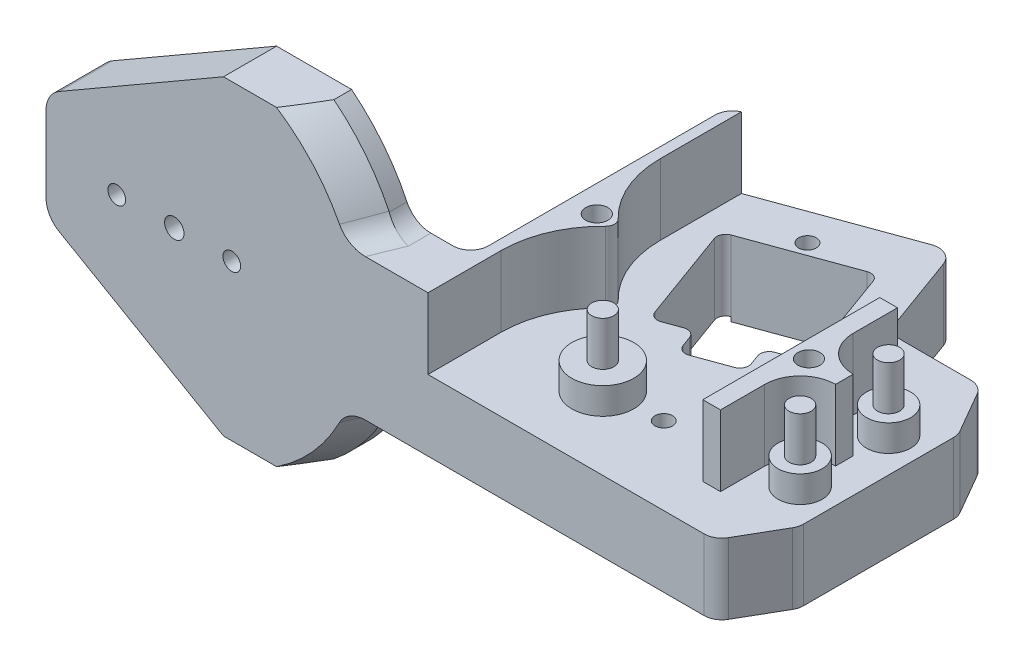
from build123d import *

# Parameters (mm, degrees)
SKETCH1_R             = 22.5
BOSS_EXTRUDE1_DEPTH   = 2
BOSS_EXTRUDE2_START   = 2
SKETCH1_2_R           = 22.5
BOSS_EXTRUDE2_DEPTH   = 4
BOSS_EXTRUDE2_TAPER   = 20
BOSS_EXTRUDE3_DEPTH   = 8
BOSS_EXTRUDE4_REACH   = 67.504
FILLET1_R             = 3
CUT_EXTRUDE1_DEPTH    = 8
FILLET2_R             = 2
SKETCH9_R             = 0.5
SKETCH9_R_2           = 4.5
SKETCH9_R_3           = 3.5
SKETCH9_R_4           = 1
SKETCH9_R_5           = 1.1
CUT_EXTRUDE4_DEPTH    = 1
SKETCH9_4_R           = 1
SKETCH9_4_R_2         = 1.1
CUT_EXTRUDE5_DEPTH    = 77.919818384
SKETCH18_R            = 3.5
SKETCH18_R_2          = 2.5
BOSS_EXTRUDE6_DEPTH   = 3
SKETCH19_R            = 1.25
BOSS_EXTRUDE7_DEPTH   = 5
CUT_EXTRUDE6_DEPTH    = 77.919818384
CUT_EXTRUDE7_START    = -5
CUT_EXTRUDE7_DEPTH    = 5
BOSS_EXTRUDE8_DEPTH   = 0.5
M3_CLEARANCE_HOLE1_D  = 2
CUT_EXTRUDE8_DEPTH    = 77.919818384
FILLET3_R             = 3
M3_TAPPED_HOLE1_D     = 2.5
M3_TAPPED_HOLE1_DEPTH = 12
M3_TAPPED_HOLE1_TIP   = 0.751075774


with BuildPart() as part:
    # Sketch1 → Boss-Extrude1 (new body)
    with BuildSketch(Plane.XY):
        Circle(SKETCH1_R)
    extrude(amount=BOSS_EXTRUDE1_DEPTH)

    # Sketch1_2 → Boss-Extrude2 (add)
    with BuildSketch(Plane.XY.offset(BOSS_EXTRUDE2_START)):
        Circle(SKETCH1_2_R)
    extrude(amount=BOSS_EXTRUDE2_DEPTH, taper=BOSS_EXTRUDE2_TAPER)


with BuildPart() as body_2:
    # Sketch3 → Boss-Extrude3 (new, symmetric)
    with BuildSketch(Plane(origin=(0, 0, 0), x_dir=(1, 0, 0), z_dir=(0, 1, 0))):
        Polygon((21.044119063, -6), (61.044119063, -6), (64.544119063, 0.062177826), (64.544119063, 18.062177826), (61.044119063, 24.124355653), (50.558144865, 24.124355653), (46.293852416, 35.840402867), (27.5, 29), (27.5, 0), (22.5, 0), (22.5, -2), align=None)
    extrude(amount=BOSS_EXTRUDE3_DEPTH, both=True)


    # Sketch5 → Boss-Extrude4 (add, up to next)
    with BuildSketch(Plane.ZY.offset(-27.5), mode=Mode.PRIVATE) as boss_extrude4_sk1:
        Polygon((0, -8), (2, -8), (6, -8), (6, 8), (2, 8), (0, 8), align=None)
    boss_extrude4_tool1 = extrude(boss_extrude4_sk1.sketch, amount=BOSS_EXTRUDE4_REACH, mode=Mode.PRIVATE) - part.part
    add(boss_extrude4_tool1.solids().sort_by_distance((27.5, 0, 3))[0])


with BuildPart() as part_1:
    add(part.part)

    # Combine1: union body 2
    add(body_2.part)

    # Fillet1
    fillet1_edges = [part_1.edges().sort_by_distance(p)[0] for p in [
        (20.248742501, 8, 4.000694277),
        (20.248742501, -8, 4.000694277),
        (21.029740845, 8, 1),
        (21.029740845, -8, 1),
    ]]
    fillet(fillet1_edges, radius=FILLET1_R)

    # Sketch6 → Cut-Extrude1 (cut)
    with BuildSketch(Plane(origin=(0, 8, 0), x_dir=(1, 0, 0), z_dir=(0, 1, 0))):
        with BuildLine():
            Line((28.674981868, 2.2558549), (28.674981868, -6))
            Line((28.674981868, -6), (61.044119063, -6))
            Line((61.044119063, -6), (64.544119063, 0.062177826))
            Line((64.544119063, 0.062177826), (64.544119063, 18.062177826))
            Line((64.544119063, 18.062177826), (61.044119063, 24.124355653))
            Line((61.044119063, 24.124355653), (50.558144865, 24.124355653))
            Line((50.558144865, 24.124355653), (46.293852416, 35.840402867))
            Line((46.293852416, 35.840402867), (28.674981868, 29.427658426))
            Line((28.674981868, 29.427658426), (28.674981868, 20.2558549))
            ThreePointArc((28.674981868, 20.2558549), (29.591313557, 15.757414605), (32.194280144, 11.9758549))
            ThreePointArc((32.194280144, 11.9758549), (32.500306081, 11.2558549), (32.194280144, 10.5358549))
            ThreePointArc((32.194280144, 10.5358549), (29.591313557, 6.754295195), (28.674981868, 2.2558549))
        make_face()
        with BuildLine():
            Line((54.674981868, -0.937822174), (54.674981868, 19.062177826))
            Line((54.674981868, 19.062177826), (56.674981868, 19.062177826))
            Line((56.674981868, 19.062177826), (56.674981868, 14.062177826))
            ThreePointArc((56.674981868, 14.062177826), (57.846554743, 11.233750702), (60.674981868, 10.062177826))
            Line((60.674981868, 10.062177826), (60.674981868, 8.062177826))
            ThreePointArc((60.674981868, 8.062177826), (57.846554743, 6.890604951), (56.674981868, 4.062177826))
            Line((56.674981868, 4.062177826), (56.674981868, -0.937822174))
            Line((56.674981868, -0.937822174), (54.674981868, -0.937822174))
        make_face(mode=Mode.SUBTRACT)
    extrude(amount=-CUT_EXTRUDE1_DEPTH, mode=Mode.SUBTRACT)

    # Fillet2
    fillet2_edges = [part_1.edges().sort_by_distance(p)[0] for p in [
        (27.5, 0, 0),
        (27.5, 0, -29),
        (46.293852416, -4, -35.840402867),
        (50.558144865, -4, -24.124355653),
        (61.044119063, -4, -24.124355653),
        (64.544119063, -4, -18.062177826),
        (64.544119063, -4, -0.062177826),
        (61.044119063, -4, 6),
    ]]
    fillet(fillet2_edges, radius=FILLET2_R)

    # Sketch9 → Cut-Extrude4 (cut)
    # profile 1 of 8: a face of its own
    with BuildSketch(Plane(origin=(0, 0, 0), x_dir=(-1, 0, 0), z_dir=(0, 0, -1))):
        with BuildLine():
            Line((-6.5, 2), (-4.031128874, 2))
            ThreePointArc((-4.031128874, 2), (-3.726313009, 2.522814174), (-3.354101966, 3))
            Line((-3.354101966, 3), (-6.5, 3))
            ThreePointArc((-6.5, 3), (-9.5, 0), (-6.5, -3))
            Line((-6.5, -3), (-3.354101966, -3))
            ThreePointArc((-3.354101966, -3), (-3.726313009, -2.522814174), (-4.031128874, -2))
            Line((-4.031128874, -2), (-6.5, -2))
            ThreePointArc((-6.5, -2), (-8.5, 0), (-6.5, 2))
        make_face()
    # profile 2 of 8: a face of its own
    with BuildSketch(Plane(origin=(0, 0, 0), x_dir=(-1, 0, 0), z_dir=(0, 0, -1))):
        with Locations((4.5, 0)):
            Circle(SKETCH9_R)
    # profile 3 of 8: a face of its own
    with BuildSketch(Plane(origin=(0, 0, 0), x_dir=(-1, 0, 0), z_dir=(0, 0, -1))):
        Circle(SKETCH9_R_2)
        Circle(SKETCH9_R_3, mode=Mode.SUBTRACT)
    # profile 4 of 8: a face of its own
    with BuildSketch(Plane(origin=(0, 0, 0), x_dir=(-1, 0, 0), z_dir=(0, 0, -1))):
        with Locations((-4.5, 0)):
            Circle(SKETCH9_R)
    # profile 5 of 8: a face of its own
    with BuildSketch(Plane(origin=(0, 0, 0), x_dir=(-1, 0, 0), z_dir=(0, 0, -1))):
        with BuildLine():
            ThreePointArc((-4.472222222, 0.499227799), (-4.317386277, 1.268927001), (-4.031128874, 2))
            Line((-4.031128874, 2), (-6.5, 2))
            ThreePointArc((-6.5, 2), (-8.5, 0), (-6.5, -2))
            Line((-6.5, -2), (-4.031128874, -2))
            ThreePointArc((-4.031128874, -2), (-4.317386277, -1.268927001), (-4.472222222, -0.499227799))
            ThreePointArc((-4.472222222, -0.499227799), (-5, 0), (-4.472222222, 0.499227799))
        make_face()
        with Locations((-6.5, 0)):
            Circle(SKETCH9_R_4, mode=Mode.SUBTRACT)
    # profile 6 of 8: a face of its own
    with BuildSketch(Plane(origin=(0, 0, 0), x_dir=(-1, 0, 0), z_dir=(0, 0, -1))):
        Circle(SKETCH9_R_3)
        Circle(SKETCH9_R_5, mode=Mode.SUBTRACT)
    # profile 7 of 8: a face of its own
    with BuildSketch(Plane(origin=(0, 0, 0), x_dir=(-1, 0, 0), z_dir=(0, 0, -1))):
        with BuildLine():
            Line((6.500000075, 3), (3.354101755, 3.000000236))
            ThreePointArc((3.354101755, 3.000000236), (3.726312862, 2.522814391), (4.031128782, 2.000000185))
            Line((4.031128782, 2.000000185), (6.5, 2))
            ThreePointArc((6.5, 2), (8.5, 0), (6.5, -2))
            Line((6.5, -2), (4.031128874, -2))
            ThreePointArc((4.031128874, -2), (3.726313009, -2.522814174), (3.354101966, -3))
            Line((3.354101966, -3), (6.5, -3))
            ThreePointArc((6.5, -3), (9.5, -3.8e-08), (6.500000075, 3))
        make_face()
    # profile 8 of 8: a face of its own
    with BuildSketch(Plane(origin=(0, 0, 0), x_dir=(-1, 0, 0), z_dir=(0, 0, -1))):
        with BuildLine():
            Line((6.5, 2), (4.031128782, 2.000000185))
            ThreePointArc((4.031128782, 2.000000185), (4.317386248, 1.2689271), (4.472222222, 0.499227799))
            ThreePointArc((4.472222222, 0.499227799), (4.843592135, 0.363241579), (5, 0))
            ThreePointArc((5, 0), (4.843592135, -0.363241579), (4.472222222, -0.499227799))
            ThreePointArc((4.472222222, -0.499227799), (4.317386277, -1.268927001), (4.031128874, -2))
            Line((4.031128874, -2), (6.5, -2))
            ThreePointArc((6.5, -2), (8.5, 0), (6.5, 2))
        make_face()
        with Locations((6.5, 0)):
            Circle(SKETCH9_R_4, mode=Mode.SUBTRACT)
    extrude(amount=-CUT_EXTRUDE4_DEPTH, mode=Mode.SUBTRACT)

    # Sketch9_4 → Cut-Extrude5 (cut, through all)
    with BuildSketch(Plane(origin=(0, 0, 0), x_dir=(-1, 0, 0), z_dir=(0, 0, -1))):
        with Locations((-6.5, 0)):
            Circle(SKETCH9_4_R)
        Circle(SKETCH9_4_R_2)
        with Locations((6.5, 0)):
            Circle(SKETCH9_4_R)
    extrude(amount=-CUT_EXTRUDE5_DEPTH, mode=Mode.SUBTRACT)

    # Sketch18 → Boss-Extrude6 (add)
    with BuildSketch(Plane(origin=(0, 0, 0), x_dir=(1, 0, 0), z_dir=(0, 1, 0))):
        with Locations(Location((40.174981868, 2.2558549, 0), (0, 0, 270))):
            Circle(SKETCH18_R)
        with Locations(Location((60.674981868, 14.062177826, 0), (0, 0, 270))):
            Circle(SKETCH18_R_2)
        with Locations(Location((60.674981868, 4.062177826, 0), (0, 0, 270))):
            Circle(SKETCH18_R_2)
    extrude(amount=BOSS_EXTRUDE6_DEPTH)

    # Sketch19 → Boss-Extrude7 (add)
    with BuildSketch(Plane(origin=(0, 3, 0), x_dir=(1, 0, 0), z_dir=(0, 1, 0))):
        with Locations(Location((40.174981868, 2.2558549, 0), (0, 0, 270))):
            Circle(SKETCH19_R)
        with Locations(Location((60.674981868, 14.062177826, 0), (0, 0, 270))):
            Circle(SKETCH19_R)
        with Locations(Location((60.674981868, 4.062177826, 0), (0, 0, 270))):
            Circle(SKETCH19_R)
    extrude(amount=BOSS_EXTRUDE7_DEPTH)

    # Sketch20 → Cut-Extrude6 (cut, through all)
    with BuildSketch(Plane(origin=(0, 0, 0), x_dir=(1, 0, 0), z_dir=(0, 1, 0))):
        with BuildLine():
            Line((32.14268514, 24.781582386), (43.418996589, 28.885824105))
            ThreePointArc((43.418996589, 28.885824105), (44.183634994, 28.852439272), (44.700709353, 28.288151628))
            Line((44.700709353, 28.288151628), (48.548435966, 17.716609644))
            ThreePointArc((48.548435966, 17.716609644), (48.515051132, 16.951971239), (47.950763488, 16.43489688))
            Line((47.950763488, 16.43489688), (46.07607965, 15.752567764))
            ThreePointArc((46.07607965, 15.752567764), (45.511792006, 15.235493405), (45.478407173, 14.470855))
            Line((45.478407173, 14.470855), (45.905932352, 13.296239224))
            ThreePointArc((45.905932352, 13.296239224), (45.872547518, 12.531600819), (45.308259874, 12.01452646))
            Line((45.308259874, 12.01452646), (41.540086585, 10.643023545))
            ThreePointArc((41.540086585, 10.643023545), (40.775448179, 10.676408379), (40.25837382, 11.240696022))
            Line((40.25837382, 11.240696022), (39.830848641, 12.415311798))
            ThreePointArc((39.830848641, 12.415311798), (39.313774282, 12.979599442), (38.549135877, 13.012984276))
            Line((38.549135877, 13.012984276), (36.674452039, 12.33065516))
            ThreePointArc((36.674452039, 12.33065516), (35.909813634, 12.364039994), (35.392739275, 12.928327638))
            Line((35.392739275, 12.928327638), (31.545012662, 23.499869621))
            ThreePointArc((31.545012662, 23.499869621), (31.578397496, 24.264508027), (32.14268514, 24.781582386))
        make_face()
    extrude(amount=-CUT_EXTRUDE6_DEPTH, mode=Mode.SUBTRACT)

    # Sketch21 → Cut-Extrude7 (cut)
    with BuildSketch(Plane.XZ.offset(8).offset(CUT_EXTRUDE7_START)):
        with BuildLine():
            Line((49.140832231, -16.089014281), (52.56717265, -6.67522135))
            Line((52.56717265, -6.67522135), (39.411475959, -1.886939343))
            Line((39.411475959, -1.886939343), (35.98513554, -11.300732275))
            Line((35.98513554, -11.300732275), (35.392739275, -12.928327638))
            ThreePointArc((35.392739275, -12.928327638), (35.909813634, -12.364039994), (36.674452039, -12.33065516))
            Line((36.674452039, -12.33065516), (38.549135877, -13.012984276))
            ThreePointArc((38.549135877, -13.012984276), (39.313774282, -12.979599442), (39.830848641, -12.415311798))
            Line((39.830848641, -12.415311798), (40.25837382, -11.240696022))
            ThreePointArc((40.25837382, -11.240696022), (40.775448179, -10.676408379), (41.540086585, -10.643023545))
            Line((41.540086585, -10.643023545), (45.308259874, -12.01452646))
            ThreePointArc((45.308259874, -12.01452646), (45.872547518, -12.531600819), (45.905932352, -13.296239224))
            Line((45.905932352, -13.296239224), (45.478407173, -14.470855))
            ThreePointArc((45.478407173, -14.470855), (45.511792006, -15.235493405), (46.07607965, -15.752567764))
            Line((46.07607965, -15.752567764), (47.950763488, -16.43489688))
            ThreePointArc((47.950763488, -16.43489688), (48.515051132, -16.951971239), (48.548435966, -17.716609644))
            Line((48.548435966, -17.716609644), (49.140832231, -16.089014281))
        make_face()
    extrude(amount=CUT_EXTRUDE7_DEPTH, mode=Mode.SUBTRACT)

    # Sketch22 → Boss-Extrude8 (add)
    with BuildSketch(Plane.XZ.offset(8)):
        Polygon((52.995560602, -2.574430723), (41.719249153, 1.529810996), (40.35116858, -2.228959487), (51.627480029, -6.333201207), align=None)
        Polygon((42.050916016, -32.644594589), (43.418996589, -28.885824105), (32.14268514, -24.781582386), (30.774604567, -28.540352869), align=None)
    extrude(amount=BOSS_EXTRUDE8_DEPTH)

    # M3 Clearance Hole1 (through all)
    with Locations(Plane(origin=(0, -8.5, 0), x_dir=(-1, 0, 0), z_dir=(0, -1, 0))):
        with Locations((-37.23846996, 28.323855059), (-46.531695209, 2.790928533)):
            Hole(M3_CLEARANCE_HOLE1_D / 2)

    # Sketch26 → Cut-Extrude8 (cut, through all)
    with BuildSketch(Plane(origin=(0, 0, 0), x_dir=(-1, 0, 0), z_dir=(0, 0, -1))):
        with BuildLine():
            Line((-5.562150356, 17.582887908), (-10.009836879, 20.15076092))
            ThreePointArc((-10.009836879, 20.15076092), (-12.092745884, 18.974074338), (-14.03894771, 17.582887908))
            Line((-14.03894771, 17.582887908), (-5.562150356, 17.582887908))
        make_face()
        with BuildLine():
            ThreePointArc((22.5, 0), (11.853874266, 19.124216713), (-10.009836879, 20.15076092))
            Line((-10.009836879, 20.15076092), (-5.562150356, 17.582887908))
            Line((-5.562150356, 17.582887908), (14.5, 6))
            Line((14.5, 6), (14.5, 0))
            Line((14.5, 0), (22.5, 0))
        make_face()
        with BuildLine():
            ThreePointArc((-10.009836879, -20.15076092), (11.853874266, -19.124216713), (22.5, 0))
            Line((22.5, 0), (14.5, 0))
            Line((14.5, 0), (14.5, -6))
            Line((14.5, -6), (-5.562150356, -17.582887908))
            Line((-5.562150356, -17.582887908), (-10.009836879, -20.15076092))
        make_face()
        with BuildLine():
            ThreePointArc((-14.03894771, -17.582887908), (-12.092745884, -18.974074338), (-10.009836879, -20.15076092))
            Line((-10.009836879, -20.15076092), (-5.562150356, -17.582887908))
            Line((-5.562150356, -17.582887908), (-14.03894771, -17.582887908))
        make_face()
    extrude(amount=-CUT_EXTRUDE8_DEPTH, mode=Mode.SUBTRACT)

    # Fillet3
    fillet3_edges = [part_1.edges().sort_by_distance(p)[0] for p in [
        (-14.5, -6, 3),
        (-14.5, 6, 3),
    ]]
    fillet(fillet3_edges, radius=FILLET3_R)

    # M3 Tapped Hole1
    with Locations(Plane(origin=(0, 8, 0), x_dir=(1, 0, 0), z_dir=(0, 1, 0))):
        with Locations((30.5, 11.2558549), (56.674981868, 9.062177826)):
            Hole(M3_TAPPED_HOLE1_D / 2, depth=M3_TAPPED_HOLE1_DEPTH)
            with Locations((0, 0, -(M3_TAPPED_HOLE1_DEPTH + M3_TAPPED_HOLE1_TIP / 2))):  # 118° drill point
                Cone(0, M3_TAPPED_HOLE1_D / 2, M3_TAPPED_HOLE1_TIP, mode=Mode.SUBTRACT)


solid = part_1.part
